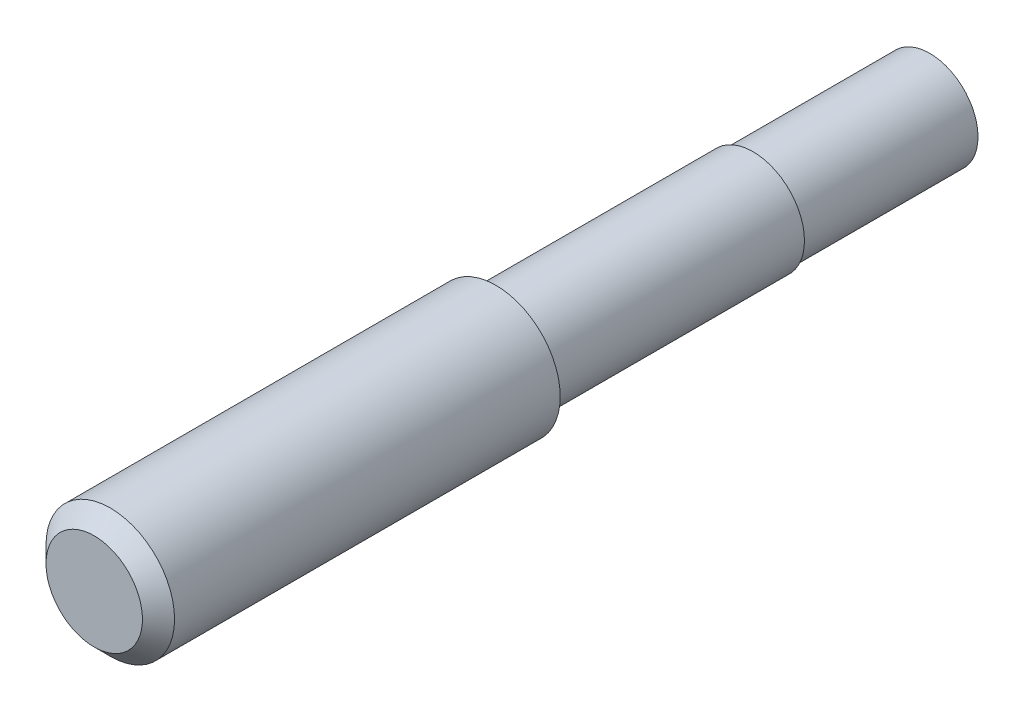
ISO-10303-21;
HEADER;
FILE_DESCRIPTION(('STEP AP214'),'2;1');
FILE_NAME('part.step','',(''),(''),'','','');
FILE_SCHEMA(('AUTOMOTIVE_DESIGN { 1 0 10303 214 1 1 1 1 }'));
ENDSEC;
DATA;
#1=APPLICATION_CONTEXT('core data for automotive mechanical design processes');
#2=APPLICATION_PROTOCOL_DEFINITION('international standard','automotive_design',2000,#1);
#3=PRODUCT_CONTEXT('',#1,'mechanical');
#4=PRODUCT('Part','Part','',(#3));
#5=PRODUCT_RELATED_PRODUCT_CATEGORY('part','',(#4));
#6=PRODUCT_DEFINITION_FORMATION('','',#4);
#7=PRODUCT_DEFINITION_CONTEXT('part definition',#1,'design');
#8=PRODUCT_DEFINITION('design','',#6,#7);
#9=PRODUCT_DEFINITION_SHAPE('','',#8);
#10=(LENGTH_UNIT() NAMED_UNIT(*) SI_UNIT(.MILLI.,.METRE.));
#11=(NAMED_UNIT(*) PLANE_ANGLE_UNIT() SI_UNIT($,.RADIAN.));
#12=(NAMED_UNIT(*) SI_UNIT($,.STERADIAN.) SOLID_ANGLE_UNIT());
#13=UNCERTAINTY_MEASURE_WITH_UNIT(LENGTH_MEASURE(1.E-05),#10,'distance_accuracy_value','');
#14=(GEOMETRIC_REPRESENTATION_CONTEXT(3) GLOBAL_UNCERTAINTY_ASSIGNED_CONTEXT((#13)) GLOBAL_UNIT_ASSIGNED_CONTEXT((#10,
#11,#12)) REPRESENTATION_CONTEXT('',''));
#15=CARTESIAN_POINT('',(0.,0.,0.));
#16=DIRECTION('',(0.,0.,1.));
#17=DIRECTION('',(1.,0.,0.));
#18=AXIS2_PLACEMENT_3D('',#15,#16,#17);
#19=CARTESIAN_POINT('',(0.,0.,0.));
#20=DIRECTION('',(0.,0.,-1.));
#21=DIRECTION('',(-1.,0.,0.));
#22=AXIS2_PLACEMENT_3D('',#19,#20,#21);
#23=PLANE('',#22);
#24=CARTESIAN_POINT('',(0.,0.,0.));
#25=DIRECTION('',(0.,0.,1.));
#26=DIRECTION('',(1.,0.,0.));
#27=AXIS2_PLACEMENT_3D('',#24,#25,#26);
#28=CIRCLE('',#27,3.);
#29=CARTESIAN_POINT('',(3.,0.,0.));
#30=VERTEX_POINT('',#29);
#31=EDGE_CURVE('E17',#30,#30,#28,.T.);
#32=ORIENTED_EDGE('',*,*,#31,.F.);
#33=EDGE_LOOP('',(#32));
#34=FACE_BOUND('',#33,.T.);
#35=ADVANCED_FACE('F14',(#34),#23,.T.);
#36=CARTESIAN_POINT('',(0.,0.,0.));
#37=DIRECTION('',(0.,0.,1.));
#38=DIRECTION('',(1.,0.,0.));
#39=AXIS2_PLACEMENT_3D('',#36,#37,#38);
#40=CYLINDRICAL_SURFACE('',#39,3.);
#41=ORIENTED_EDGE('',*,*,#31,.T.);
#42=EDGE_LOOP('',(#41));
#43=FACE_BOUND('',#42,.T.);
#44=CARTESIAN_POINT('',(0.,0.,11.));
#45=DIRECTION('',(0.,0.,1.));
#46=DIRECTION('',(1.,0.,0.));
#47=AXIS2_PLACEMENT_3D('',#44,#45,#46);
#48=CIRCLE('',#47,3.);
#49=CARTESIAN_POINT('',(3.,0.,11.));
#50=VERTEX_POINT('',#49);
#51=EDGE_CURVE('E38',#50,#50,#48,.T.);
#52=ORIENTED_EDGE('',*,*,#51,.F.);
#53=EDGE_LOOP('',(#52));
#54=FACE_BOUND('',#53,.T.);
#55=ADVANCED_FACE('F45',(#43,#54),#40,.T.);
#56=CARTESIAN_POINT('',(0.,0.,11.));
#57=DIRECTION('',(0.,0.,-1.));
#58=DIRECTION('',(-1.,0.,0.));
#59=AXIS2_PLACEMENT_3D('',#56,#57,#58);
#60=PLANE('',#59);
#61=ORIENTED_EDGE('',*,*,#51,.T.);
#62=EDGE_LOOP('',(#61));
#63=FACE_BOUND('',#62,.T.);
#64=CARTESIAN_POINT('',(0.,0.,11.));
#65=DIRECTION('',(0.,0.,1.));
#66=DIRECTION('',(1.,0.,0.));
#67=AXIS2_PLACEMENT_3D('',#64,#65,#66);
#68=CIRCLE('',#67,3.2);
#69=CARTESIAN_POINT('',(3.2,0.,11.));
#70=VERTEX_POINT('',#69);
#71=EDGE_CURVE('E36',#70,#70,#68,.T.);
#72=ORIENTED_EDGE('',*,*,#71,.F.);
#73=EDGE_LOOP('',(#72));
#74=FACE_BOUND('',#73,.T.);
#75=ADVANCED_FACE('F53',(#63,#74),#60,.T.);
#76=CARTESIAN_POINT('',(0.,0.,11.));
#77=DIRECTION('',(0.,0.,1.));
#78=DIRECTION('',(1.,0.,0.));
#79=AXIS2_PLACEMENT_3D('',#76,#77,#78);
#80=CYLINDRICAL_SURFACE('',#79,3.2);
#81=ORIENTED_EDGE('',*,*,#71,.T.);
#82=EDGE_LOOP('',(#81));
#83=FACE_BOUND('',#82,.T.);
#84=CARTESIAN_POINT('',(0.,0.,27.));
#85=DIRECTION('',(0.,0.,1.));
#86=DIRECTION('',(1.,0.,0.));
#87=AXIS2_PLACEMENT_3D('',#84,#85,#86);
#88=CIRCLE('',#87,3.2);
#89=CARTESIAN_POINT('',(3.2,0.,27.));
#90=VERTEX_POINT('',#89);
#91=EDGE_CURVE('E33',#90,#90,#88,.T.);
#92=ORIENTED_EDGE('',*,*,#91,.F.);
#93=EDGE_LOOP('',(#92));
#94=FACE_BOUND('',#93,.T.);
#95=ADVANCED_FACE('F72',(#83,#94),#80,.T.);
#96=CARTESIAN_POINT('',(0.,0.,52.));
#97=DIRECTION('',(0.,0.,-1.));
#98=DIRECTION('',(-1.,0.,0.));
#99=AXIS2_PLACEMENT_3D('',#96,#97,#98);
#100=PLANE('',#99);
#101=CARTESIAN_POINT('',(0.,0.,52.0000000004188));
#102=DIRECTION('',(0.,0.,-1.));
#103=DIRECTION('',(-1.,0.,0.));
#104=AXIS2_PLACEMENT_3D('',#101,#102,#103);
#105=CIRCLE('',#104,3.00000000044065);
#106=CARTESIAN_POINT('',(-3.00000000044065,0.,52.0000000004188));
#107=VERTEX_POINT('',#106);
#108=EDGE_CURVE('E26',#107,#107,#105,.T.);
#109=ORIENTED_EDGE('',*,*,#108,.F.);
#110=EDGE_LOOP('',(#109));
#111=FACE_BOUND('',#110,.T.);
#112=ADVANCED_FACE('F68',(#111),#100,.F.);
#113=CARTESIAN_POINT('',(0.,0.,27.));
#114=DIRECTION('',(0.,0.,-1.));
#115=DIRECTION('',(-1.,0.,0.));
#116=AXIS2_PLACEMENT_3D('',#113,#114,#115);
#117=PLANE('',#116);
#118=ORIENTED_EDGE('',*,*,#91,.T.);
#119=EDGE_LOOP('',(#118));
#120=FACE_BOUND('',#119,.T.);
#121=CARTESIAN_POINT('',(0.,0.,27.));
#122=DIRECTION('',(0.,0.,1.));
#123=DIRECTION('',(1.,0.,0.));
#124=AXIS2_PLACEMENT_3D('',#121,#122,#123);
#125=CIRCLE('',#124,4.);
#126=CARTESIAN_POINT('',(4.,0.,27.));
#127=VERTEX_POINT('',#126);
#128=EDGE_CURVE('E21',#127,#127,#125,.T.);
#129=ORIENTED_EDGE('',*,*,#128,.F.);
#130=EDGE_LOOP('',(#129));
#131=FACE_BOUND('',#130,.T.);
#132=ADVANCED_FACE('F61',(#120,#131),#117,.T.);
#133=CARTESIAN_POINT('',(0.,0.,50.9999999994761));
#134=DIRECTION('',(0.,0.,-1.));
#135=DIRECTION('',(-1.,0.,0.));
#136=AXIS2_PLACEMENT_3D('',#133,#134,#135);
#137=CONICAL_SURFACE('',#136,3.99999999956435,0.785398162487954);
#138=CARTESIAN_POINT('',(0.,0.,51.));
#139=DIRECTION('',(0.,0.,1.));
#140=DIRECTION('',(1.,0.,0.));
#141=AXIS2_PLACEMENT_3D('',#138,#139,#140);
#142=CIRCLE('',#141,4.);
#143=CARTESIAN_POINT('',(4.,0.,51.));
#144=VERTEX_POINT('',#143);
#145=EDGE_CURVE('E10',#144,#144,#142,.F.);
#146=ORIENTED_EDGE('',*,*,#145,.F.);
#147=EDGE_LOOP('',(#146));
#148=FACE_BOUND('',#147,.T.);
#149=ORIENTED_EDGE('',*,*,#108,.T.);
#150=EDGE_LOOP('',(#149));
#151=FACE_BOUND('',#150,.T.);
#152=ADVANCED_FACE('F56',(#148,#151),#137,.T.);
#153=CARTESIAN_POINT('',(0.,0.,27.));
#154=DIRECTION('',(0.,0.,1.));
#155=DIRECTION('',(1.,0.,0.));
#156=AXIS2_PLACEMENT_3D('',#153,#154,#155);
#157=CYLINDRICAL_SURFACE('',#156,4.);
#158=ORIENTED_EDGE('',*,*,#145,.T.);
#159=EDGE_LOOP('',(#158));
#160=FACE_BOUND('',#159,.T.);
#161=ORIENTED_EDGE('',*,*,#128,.T.);
#162=EDGE_LOOP('',(#161));
#163=FACE_BOUND('',#162,.T.);
#164=ADVANCED_FACE('F54',(#160,#163),#157,.T.);
#165=CLOSED_SHELL('',(#35,#55,#75,#95,#112,#132,#152,#164));
#166=MANIFOLD_SOLID_BREP('B1',#165);
#167=ADVANCED_BREP_SHAPE_REPRESENTATION('',(#18,#166),#14);
#168=SHAPE_DEFINITION_REPRESENTATION(#9,#167);
ENDSEC;
END-ISO-10303-21;
